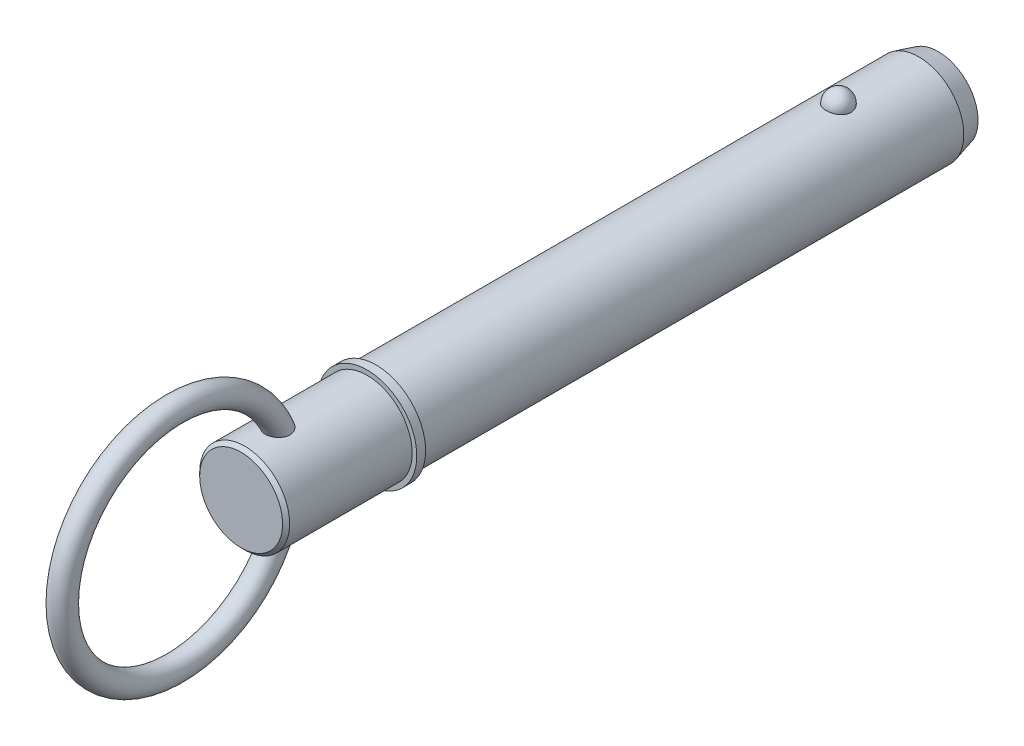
ISO-10303-21;
HEADER;
FILE_DESCRIPTION(('STEP AP214'),'2;1');
FILE_NAME('part.step','',(''),(''),'','','');
FILE_SCHEMA(('AUTOMOTIVE_DESIGN { 1 0 10303 214 1 1 1 1 }'));
ENDSEC;
DATA;
#1=APPLICATION_CONTEXT('core data for automotive mechanical design processes');
#2=APPLICATION_PROTOCOL_DEFINITION('international standard','automotive_design',2000,#1);
#3=PRODUCT_CONTEXT('',#1,'mechanical');
#4=PRODUCT('Part','Part','',(#3));
#5=PRODUCT_RELATED_PRODUCT_CATEGORY('part','',(#4));
#6=PRODUCT_DEFINITION_FORMATION('','',#4);
#7=PRODUCT_DEFINITION_CONTEXT('part definition',#1,'design');
#8=PRODUCT_DEFINITION('design','',#6,#7);
#9=PRODUCT_DEFINITION_SHAPE('','',#8);
#10=(LENGTH_UNIT() NAMED_UNIT(*) SI_UNIT(.MILLI.,.METRE.));
#11=(NAMED_UNIT(*) PLANE_ANGLE_UNIT() SI_UNIT($,.RADIAN.));
#12=(NAMED_UNIT(*) SI_UNIT($,.STERADIAN.) SOLID_ANGLE_UNIT());
#13=UNCERTAINTY_MEASURE_WITH_UNIT(LENGTH_MEASURE(1.E-05),#10,'distance_accuracy_value','');
#14=(GEOMETRIC_REPRESENTATION_CONTEXT(3) GLOBAL_UNCERTAINTY_ASSIGNED_CONTEXT((#13)) GLOBAL_UNIT_ASSIGNED_CONTEXT((#10,
#11,#12)) REPRESENTATION_CONTEXT('',''));
#15=CARTESIAN_POINT('',(0.,0.,0.));
#16=DIRECTION('',(0.,0.,1.));
#17=DIRECTION('',(1.,0.,0.));
#18=AXIS2_PLACEMENT_3D('',#15,#16,#17);
#19=CARTESIAN_POINT('',(0.,0.,127.));
#20=DIRECTION('',(0.,0.,-1.));
#21=DIRECTION('',(-1.,0.,0.));
#22=AXIS2_PLACEMENT_3D('',#19,#20,#21);
#23=CYLINDRICAL_SURFACE('',#22,12.7);
#24=CARTESIAN_POINT('',(3.52486003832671,12.2010393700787,-3.56));
#25=CARTESIAN_POINT('',(3.52485671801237,12.2010422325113,-3.3610062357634));
#26=CARTESIAN_POINT('',(3.50863187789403,12.2057632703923,-3.16197042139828));
#27=CARTESIAN_POINT('',(3.4441205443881,12.2241207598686,-2.76953945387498));
#28=CARTESIAN_POINT('',(3.39582213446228,12.2377605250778,-2.57614642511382));
#29=CARTESIAN_POINT('',(3.26839193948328,12.2724057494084,-2.20059799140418));
#30=CARTESIAN_POINT('',(3.18927369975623,12.2934079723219,-2.01843769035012));
#31=CARTESIAN_POINT('',(3.00217139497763,12.3404306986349,-1.6703228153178));
#32=CARTESIAN_POINT('',(2.89418796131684,12.3664510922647,-1.50436788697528));
#33=CARTESIAN_POINT('',(2.65144862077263,12.4207616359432,-1.19241975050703));
#34=CARTESIAN_POINT('',(2.51656310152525,12.4490623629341,-1.04652919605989));
#35=CARTESIAN_POINT('',(2.22383249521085,12.5046678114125,-0.779711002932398));
#36=CARTESIAN_POINT('',(2.0659873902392,12.5319725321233,-0.658783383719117));
#37=CARTESIAN_POINT('',(1.73204520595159,12.5824645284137,-0.445586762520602));
#38=CARTESIAN_POINT('',(1.55600183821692,12.6056634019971,-0.353236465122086));
#39=CARTESIAN_POINT('',(1.19021695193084,12.6454411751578,-0.199381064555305));
#40=CARTESIAN_POINT('',(1.00047694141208,12.6620208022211,-0.137872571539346));
#41=CARTESIAN_POINT('',(0.616329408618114,12.6864692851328,-0.0483191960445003));
#42=CARTESIAN_POINT('',(0.422067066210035,12.6944893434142,-0.0196927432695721));
#43=CARTESIAN_POINT('',(0.0313259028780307,12.7014637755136,0.00524116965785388));
#44=CARTESIAN_POINT('',(-0.165152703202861,12.7004190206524,0.00155173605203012));
#45=CARTESIAN_POINT('',(-0.551780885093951,12.6894611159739,-0.0377454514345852));
#46=CARTESIAN_POINT('',(-0.74198078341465,12.6796749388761,-0.0728962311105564));
#47=CARTESIAN_POINT('',(-1.11361063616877,12.6524544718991,-0.173489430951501));
#48=CARTESIAN_POINT('',(-1.29504043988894,12.6350200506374,-0.238932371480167));
#49=CARTESIAN_POINT('',(-1.64521311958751,12.5942270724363,-0.398772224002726));
#50=CARTESIAN_POINT('',(-1.81387645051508,12.5708347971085,-0.493334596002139));
#51=CARTESIAN_POINT('',(-2.13292959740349,12.5206522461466,-0.708731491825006));
#52=CARTESIAN_POINT('',(-2.28331755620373,12.4938616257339,-0.829568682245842));
#53=CARTESIAN_POINT('',(-2.56470285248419,12.4391828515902,-1.0968714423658));
#54=CARTESIAN_POINT('',(-2.69527522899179,12.4112835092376,-1.24378221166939));
#55=CARTESIAN_POINT('',(-2.93023079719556,12.3579248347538,-1.55763192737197));
#56=CARTESIAN_POINT('',(-3.03461212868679,12.3324656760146,-1.72457229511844));
#57=CARTESIAN_POINT('',(-3.21564423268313,12.2865167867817,-2.07598316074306));
#58=CARTESIAN_POINT('',(-3.29196222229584,12.2660875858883,-2.26063321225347));
#59=CARTESIAN_POINT('',(-3.41323771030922,12.2328979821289,-2.64061334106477));
#60=CARTESIAN_POINT('',(-3.45819611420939,12.2201373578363,-2.83594310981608));
#61=CARTESIAN_POINT('',(-3.51550038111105,12.2037762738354,-3.2308649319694));
#62=CARTESIAN_POINT('',(-3.5279827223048,12.200137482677,-3.43043558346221));
#63=CARTESIAN_POINT('',(-3.52041430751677,12.2023234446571,-3.8289025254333));
#64=CARTESIAN_POINT('',(-3.50036443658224,12.2081479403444,-4.02779883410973));
#65=CARTESIAN_POINT('',(-3.42842010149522,12.2285446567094,-4.41824213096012));
#66=CARTESIAN_POINT('',(-3.37668525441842,12.243073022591,-4.6098208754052));
#67=CARTESIAN_POINT('',(-3.24279085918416,12.2792134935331,-4.98132360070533));
#68=CARTESIAN_POINT('',(-3.16063009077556,12.300825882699,-5.16124711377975));
#69=CARTESIAN_POINT('',(-2.96738224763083,12.3488691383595,-5.50542856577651));
#70=CARTESIAN_POINT('',(-2.85613997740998,12.3753256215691,-5.66959579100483));
#71=CARTESIAN_POINT('',(-2.60773241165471,12.4300386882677,-5.97665065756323));
#72=CARTESIAN_POINT('',(-2.47056612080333,12.458295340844,-6.11953748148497));
#73=CARTESIAN_POINT('',(-2.17327999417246,12.5135827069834,-6.38059312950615));
#74=CARTESIAN_POINT('',(-2.01307652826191,12.5406084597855,-6.49866785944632));
#75=CARTESIAN_POINT('',(-1.67442544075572,12.5902954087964,-6.70609314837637));
#76=CARTESIAN_POINT('',(-1.49597909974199,12.6129569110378,-6.79544572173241));
#77=CARTESIAN_POINT('',(-1.12819666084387,12.6511224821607,-6.94192787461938));
#78=CARTESIAN_POINT('',(-0.93902400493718,12.666712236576,-6.99944518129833));
#79=CARTESIAN_POINT('',(-0.553267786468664,12.6894125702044,-7.08227444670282));
#80=CARTESIAN_POINT('',(-0.356685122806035,12.6965241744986,-7.10759029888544));
#81=CARTESIAN_POINT('',(0.0343320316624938,12.7014305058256,-7.12510946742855));
#82=CARTESIAN_POINT('',(0.228736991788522,12.6993986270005,-7.11792901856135));
#83=CARTESIAN_POINT('',(0.613493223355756,12.6866339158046,-7.07206766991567));
#84=CARTESIAN_POINT('',(0.803844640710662,12.6759013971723,-7.03338790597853));
#85=CARTESIAN_POINT('',(1.17440741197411,12.6469443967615,-6.925834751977));
#86=CARTESIAN_POINT('',(1.35465462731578,12.6287486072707,-6.85707692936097));
#87=CARTESIAN_POINT('',(1.70092526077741,12.5867908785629,-6.69128257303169));
#88=CARTESIAN_POINT('',(1.86694777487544,12.5630285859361,-6.59424424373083));
#89=CARTESIAN_POINT('',(2.18289085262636,12.5120350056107,-6.3727748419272));
#90=CARTESIAN_POINT('',(2.33252391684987,12.4847559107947,-6.24794475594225));
#91=CARTESIAN_POINT('',(2.60889724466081,12.4299457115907,-5.97511730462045));
#92=CARTESIAN_POINT('',(2.73563353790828,12.4024145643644,-5.82711592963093));
#93=CARTESIAN_POINT('',(2.96505559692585,12.3495984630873,-5.5091226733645));
#94=CARTESIAN_POINT('',(3.06728335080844,12.3243610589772,-5.33879227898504));
#95=CARTESIAN_POINT('',(3.24218794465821,12.2795120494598,-4.98295005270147));
#96=CARTESIAN_POINT('',(3.31487538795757,12.2598984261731,-4.79744369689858));
#97=CARTESIAN_POINT('',(3.42255689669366,12.2302435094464,-4.43775244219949));
#98=CARTESIAN_POINT('',(3.46085292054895,12.2193780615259,-4.264615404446));
#99=CARTESIAN_POINT('',(3.5120056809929,12.2047747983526,-3.9143299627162));
#100=CARTESIAN_POINT('',(3.52486299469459,12.2010368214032,-3.73718164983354));
#101=CARTESIAN_POINT('',(3.52486003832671,12.2010393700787,-3.56));
#102=B_SPLINE_CURVE_WITH_KNOTS('',3,(#24,#25,#26,#27,#28,#29,#30,#31,#32,#33,#34,#35,#36,#37,
#38,#39,#40,#41,#42,#43,#44,#45,#46,#47,#48,#49,#50,#51,#52,#53,#54,#55,#56,#57,#58,#59,#60,#61,
#62,#63,#64,#65,#66,#67,#68,#69,#70,#71,#72,#73,#74,#75,#76,#77,#78,#79,#80,#81,#82,#83,#84,#85,
#86,#87,#88,#89,#90,#91,#92,#93,#94,#95,#96,#97,#98,#99,#100,#101),.UNSPECIFIED.,.T.,.F.,(4,2,2,
2,2,2,2,2,2,2,2,2,2,2,2,2,2,2,2,2,2,2,2,2,2,2,2,2,2,2,2,2,2,2,2,2,2,2,4),(0.,0.596344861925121,
1.19291141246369,1.78921606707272,2.38550767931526,2.98474477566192,3.58398233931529,
4.18149920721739,4.77895038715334,5.36566361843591,5.95232045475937,6.53059198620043,
7.10887345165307,7.6905033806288,8.27219236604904,8.86498552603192,9.45782077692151,
10.0574751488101,10.6571122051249,11.2542252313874,11.8513220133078,12.4454353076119,
13.0395724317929,13.636947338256,14.2343451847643,14.8339691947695,15.4335511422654,
16.0256602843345,16.6176978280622,17.1985559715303,17.7793931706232,18.3580179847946,
18.9366795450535,19.5242567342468,20.1119357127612,20.7098642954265,21.3075780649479,
21.8385683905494,22.3695466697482),.UNSPECIFIED.);
#103=CARTESIAN_POINT('',(3.52486003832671,12.2010393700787,-3.56));
#104=VERTEX_POINT('',#103);
#105=EDGE_CURVE('E101',#104,#104,#102,.T.);
#106=ORIENTED_EDGE('',*,*,#105,.T.);
#107=EDGE_LOOP('',(#106));
#108=FACE_BOUND('',#107,.T.);
#109=CARTESIAN_POINT('',(0.,0.,-26.2499999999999));
#110=DIRECTION('',(0.,0.,-1.));
#111=DIRECTION('',(-1.,0.,0.));
#112=AXIS2_PLACEMENT_3D('',#109,#110,#111);
#113=CIRCLE('',#112,12.7);
#114=CARTESIAN_POINT('',(-12.7,0.,-26.2499999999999));
#115=VERTEX_POINT('',#114);
#116=EDGE_CURVE('E108',#115,#115,#113,.F.);
#117=ORIENTED_EDGE('',*,*,#116,.T.);
#118=EDGE_LOOP('',(#117));
#119=FACE_BOUND('',#118,.T.);
#120=CARTESIAN_POINT('',(0.,0.,127.));
#121=DIRECTION('',(0.,0.,1.));
#122=DIRECTION('',(1.,0.,0.));
#123=AXIS2_PLACEMENT_3D('',#120,#121,#122);
#124=CIRCLE('',#123,12.7);
#125=CARTESIAN_POINT('',(12.7,0.,127.));
#126=VERTEX_POINT('',#125);
#127=EDGE_CURVE('E106',#126,#126,#124,.T.);
#128=ORIENTED_EDGE('',*,*,#127,.F.);
#129=EDGE_LOOP('',(#128));
#130=FACE_BOUND('',#129,.T.);
#131=ADVANCED_FACE('F39',(#108,#119,#130),#23,.T.);
#132=CARTESIAN_POINT('',(0.,0.,-31.75));
#133=DIRECTION('',(0.,0.,-1.));
#134=DIRECTION('',(-1.,0.,0.));
#135=AXIS2_PLACEMENT_3D('',#132,#133,#134);
#136=PLANE('',#135);
#137=CARTESIAN_POINT('',(0.,0.,-31.75));
#138=DIRECTION('',(0.,0.,-1.));
#139=DIRECTION('',(-1.,0.,0.));
#140=AXIS2_PLACEMENT_3D('',#137,#138,#139);
#141=CIRCLE('',#140,11.2262794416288);
#142=CARTESIAN_POINT('',(-11.2262794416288,0.,-31.75));
#143=VERTEX_POINT('',#142);
#144=EDGE_CURVE('E142',#143,#143,#141,.T.);
#145=ORIENTED_EDGE('',*,*,#144,.T.);
#146=EDGE_LOOP('',(#145));
#147=FACE_BOUND('',#146,.T.);
#148=ADVANCED_FACE('F87',(#147),#136,.T.);
#149=CARTESIAN_POINT('',(0.,0.,-31.75));
#150=DIRECTION('',(0.,0.,1.));
#151=DIRECTION('',(1.,0.,0.));
#152=AXIS2_PLACEMENT_3D('',#149,#150,#151);
#153=CONICAL_SURFACE('',#152,11.2262794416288,0.261799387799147);
#154=ORIENTED_EDGE('',*,*,#116,.F.);
#155=EDGE_LOOP('',(#154));
#156=FACE_BOUND('',#155,.T.);
#157=ORIENTED_EDGE('',*,*,#144,.F.);
#158=EDGE_LOOP('',(#157));
#159=FACE_BOUND('',#158,.T.);
#160=ADVANCED_FACE('F93',(#156,#159),#153,.T.);
#161=CARTESIAN_POINT('',(0.,12.7,-3.56));
#162=DIRECTION('',(0.,1.,0.));
#163=DIRECTION('',(0.,0.,-1.));
#164=AXIS2_PLACEMENT_3D('',#161,#162,#163);
#165=SPHERICAL_SURFACE('',#164,3.56);
#166=ORIENTED_EDGE('',*,*,#105,.F.);
#167=EDGE_LOOP('',(#166));
#168=FACE_BOUND('',#167,.T.);
#169=ADVANCED_FACE('F111',(#168),#165,.T.);
#170=CARTESIAN_POINT('',(0.,0.,127.));
#171=DIRECTION('',(0.,0.,-1.));
#172=DIRECTION('',(-1.,0.,0.));
#173=AXIS2_PLACEMENT_3D('',#170,#171,#172);
#174=PLANE('',#173);
#175=ORIENTED_EDGE('',*,*,#127,.T.);
#176=EDGE_LOOP('',(#175));
#177=FACE_BOUND('',#176,.T.);
#178=CARTESIAN_POINT('',(0.,0.,127.));
#179=DIRECTION('',(0.,0.,-1.));
#180=DIRECTION('',(-1.,0.,0.));
#181=AXIS2_PLACEMENT_3D('',#178,#179,#180);
#182=CIRCLE('',#181,14.);
#183=CARTESIAN_POINT('',(-14.,0.,127.));
#184=VERTEX_POINT('',#183);
#185=EDGE_CURVE('E107',#184,#184,#182,.T.);
#186=ORIENTED_EDGE('',*,*,#185,.T.);
#187=EDGE_LOOP('',(#186));
#188=FACE_BOUND('',#187,.T.);
#189=ADVANCED_FACE('F115',(#177,#188),#174,.T.);
#190=CARTESIAN_POINT('',(0.,0.,33.7287874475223));
#191=DIRECTION('',(0.,0.,-1.));
#192=DIRECTION('',(-1.,0.,0.));
#193=AXIS2_PLACEMENT_3D('',#190,#191,#192);
#194=CYLINDRICAL_SURFACE('',#193,14.);
#195=CARTESIAN_POINT('',(0.,0.,129.5));
#196=DIRECTION('',(0.,0.,-1.));
#197=DIRECTION('',(-1.,0.,0.));
#198=AXIS2_PLACEMENT_3D('',#195,#196,#197);
#199=CIRCLE('',#198,14.);
#200=CARTESIAN_POINT('',(-14.,0.,129.5));
#201=VERTEX_POINT('',#200);
#202=EDGE_CURVE('E132',#201,#201,#199,.T.);
#203=ORIENTED_EDGE('',*,*,#202,.T.);
#204=EDGE_LOOP('',(#203));
#205=FACE_BOUND('',#204,.T.);
#206=ORIENTED_EDGE('',*,*,#185,.F.);
#207=EDGE_LOOP('',(#206));
#208=FACE_BOUND('',#207,.T.);
#209=ADVANCED_FACE('F119',(#205,#208),#194,.T.);
#210=CARTESIAN_POINT('',(0.,14.,129.5));
#211=DIRECTION('',(0.,0.,1.));
#212=DIRECTION('',(1.,0.,0.));
#213=AXIS2_PLACEMENT_3D('',#210,#211,#212);
#214=PLANE('',#213);
#215=CARTESIAN_POINT('',(0.,0.,129.5));
#216=DIRECTION('',(0.,0.,1.));
#217=DIRECTION('',(1.,0.,0.));
#218=AXIS2_PLACEMENT_3D('',#215,#216,#217);
#219=CIRCLE('',#218,12.7);
#220=CARTESIAN_POINT('',(12.7,0.,129.5));
#221=VERTEX_POINT('',#220);
#222=EDGE_CURVE('E110',#221,#221,#219,.T.);
#223=ORIENTED_EDGE('',*,*,#222,.F.);
#224=EDGE_LOOP('',(#223));
#225=FACE_BOUND('',#224,.T.);
#226=ORIENTED_EDGE('',*,*,#202,.F.);
#227=EDGE_LOOP('',(#226));
#228=FACE_BOUND('',#227,.T.);
#229=ADVANCED_FACE('F84',(#225,#228),#214,.T.);
#230=CARTESIAN_POINT('',(0.,0.,165.1));
#231=DIRECTION('',(0.,0.,-1.));
#232=DIRECTION('',(-1.,0.,0.));
#233=AXIS2_PLACEMENT_3D('',#230,#231,#232);
#234=CYLINDRICAL_SURFACE('',#233,12.7);
#235=CARTESIAN_POINT('',(-1.22892607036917,-12.6404011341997,151.47119395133));
#236=CARTESIAN_POINT('',(-1.06119922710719,-12.6567092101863,151.404004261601));
#237=CARTESIAN_POINT('',(-0.887663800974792,-12.6701810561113,151.350792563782));
#238=CARTESIAN_POINT('',(-0.533823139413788,-12.6900116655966,151.273419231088));
#239=CARTESIAN_POINT('',(-0.353518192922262,-12.6963707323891,151.2492563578));
#240=CARTESIAN_POINT('',(0.00871153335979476,-12.7012887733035,151.230519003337));
#241=CARTESIAN_POINT('',(0.190636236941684,-12.699848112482,151.235943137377));
#242=CARTESIAN_POINT('',(0.550971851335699,-12.6893231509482,151.276255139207));
#243=CARTESIAN_POINT('',(0.729382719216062,-12.6802387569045,151.31114336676));
#244=CARTESIAN_POINT('',(1.0777168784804,-12.6553960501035,151.409659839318));
#245=CARTESIAN_POINT('',(1.24763507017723,-12.6396337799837,151.473305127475));
#246=CARTESIAN_POINT('',(1.57398922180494,-12.6031560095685,151.627891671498));
#247=CARTESIAN_POINT('',(1.73042571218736,-12.5824407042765,151.718831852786));
#248=CARTESIAN_POINT('',(2.02464767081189,-12.5384554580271,151.925320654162));
#249=CARTESIAN_POINT('',(2.16251370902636,-12.5151974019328,152.04075697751));
#250=CARTESIAN_POINT('',(2.41652917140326,-12.4686447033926,152.293426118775));
#251=CARTESIAN_POINT('',(2.53268123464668,-12.4453500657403,152.430656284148));
#252=CARTESIAN_POINT('',(2.7397169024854,-12.4014166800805,152.72226178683));
#253=CARTESIAN_POINT('',(2.83072997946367,-12.3807646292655,152.876543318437));
#254=CARTESIAN_POINT('',(2.98642630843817,-12.3441356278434,153.198338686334));
#255=CARTESIAN_POINT('',(3.05110876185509,-12.3281588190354,153.365852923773));
#256=CARTESIAN_POINT('',(3.15450336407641,-12.3021148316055,153.712705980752));
#257=CARTESIAN_POINT('',(3.19268116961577,-12.2921697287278,153.892212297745));
#258=CARTESIAN_POINT('',(3.24150148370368,-12.2793848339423,154.255144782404));
#259=CARTESIAN_POINT('',(3.25213515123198,-12.2765473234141,154.438572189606));
#260=CARTESIAN_POINT('',(3.24696781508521,-12.2779158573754,154.818893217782));
#261=CARTESIAN_POINT('',(3.22910261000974,-12.2826719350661,155.015753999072));
#262=CARTESIAN_POINT('',(3.1650495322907,-12.2993299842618,155.40447917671));
#263=CARTESIAN_POINT('',(3.11884966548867,-12.3112349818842,155.596341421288));
#264=CARTESIAN_POINT('',(2.99323123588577,-12.3424162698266,155.992891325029));
#265=CARTESIAN_POINT('',(2.91059577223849,-12.3623844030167,156.196505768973));
#266=CARTESIAN_POINT('',(2.71447440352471,-12.4069229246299,156.588190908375));
#267=CARTESIAN_POINT('',(2.60094970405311,-12.431499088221,156.776241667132));
#268=CARTESIAN_POINT('',(2.40499526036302,-12.4703951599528,157.047470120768));
#269=CARTESIAN_POINT('',(2.33301847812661,-12.4841083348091,157.138407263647));
#270=CARTESIAN_POINT('',(2.18106597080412,-12.5115521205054,157.313320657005));
#271=CARTESIAN_POINT('',(2.10108885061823,-12.5252827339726,157.397295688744));
#272=CARTESIAN_POINT('',(1.84973962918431,-12.5657115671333,157.636779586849));
#273=CARTESIAN_POINT('',(1.6664677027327,-12.5917488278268,157.780526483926));
#274=CARTESIAN_POINT('',(1.33551340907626,-12.6303067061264,157.985856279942));
#275=CARTESIAN_POINT('',(1.19512135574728,-12.6444898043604,158.05902243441));
#276=CARTESIAN_POINT('',(0.903945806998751,-12.6686276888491,158.181586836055));
#277=CARTESIAN_POINT('',(0.753173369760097,-12.6785868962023,158.231009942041));
#278=CARTESIAN_POINT('',(0.444090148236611,-12.6931800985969,158.302942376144));
#279=CARTESIAN_POINT('',(0.285741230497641,-12.6977833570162,158.325296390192));
#280=CARTESIAN_POINT('',(-0.0324491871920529,-12.700953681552,158.340724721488));
#281=CARTESIAN_POINT('',(-0.192290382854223,-12.6995219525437,158.333804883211));
#282=CARTESIAN_POINT('',(-0.493822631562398,-12.6912132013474,158.293209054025));
#283=CARTESIAN_POINT('',(-0.635865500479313,-12.6848307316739,158.261962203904));
#284=CARTESIAN_POINT('',(-0.913041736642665,-12.6678986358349,158.177721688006));
#285=CARTESIAN_POINT('',(-1.04817349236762,-12.6573480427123,158.124722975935));
#286=CARTESIAN_POINT('',(-1.31637898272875,-12.6323524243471,157.996233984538));
#287=CARTESIAN_POINT('',(-1.44890088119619,-12.6177203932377,157.919638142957));
#288=CARTESIAN_POINT('',(-1.70162176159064,-12.5861326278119,157.748743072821));
#289=CARTESIAN_POINT('',(-1.82181486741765,-12.569175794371,157.654435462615));
#290=CARTESIAN_POINT('',(-2.06961284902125,-12.5309682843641,157.432665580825));
#291=CARTESIAN_POINT('',(-2.1945762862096,-12.5094982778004,157.30229330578));
#292=CARTESIAN_POINT('',(-2.4250376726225,-12.4668738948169,157.025308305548));
#293=CARTESIAN_POINT('',(-2.53052086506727,-12.4457197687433,156.878683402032));
#294=CARTESIAN_POINT('',(-2.73961150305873,-12.4015349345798,156.543065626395));
#295=CARTESIAN_POINT('',(-2.83895917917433,-12.3789253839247,156.351346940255));
#296=CARTESIAN_POINT('',(-3.00725804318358,-12.3391195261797,155.954405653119));
#297=CARTESIAN_POINT('',(-3.07618857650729,-12.3219268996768,155.749173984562));
#298=CARTESIAN_POINT('',(-3.18528660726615,-12.2942052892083,155.313754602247));
#299=CARTESIAN_POINT('',(-3.22287145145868,-12.2842816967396,155.082855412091));
#300=CARTESIAN_POINT('',(-3.24821271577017,-12.2775854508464,154.734351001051));
#301=CARTESIAN_POINT('',(-3.25148236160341,-12.276719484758,154.617777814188));
#302=CARTESIAN_POINT('',(-3.24729041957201,-12.2778310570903,154.384859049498));
#303=CARTESIAN_POINT('',(-3.23983534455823,-12.2798068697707,154.268513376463));
#304=CARTESIAN_POINT('',(-3.21488959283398,-12.286359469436,154.04622762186));
#305=CARTESIAN_POINT('',(-3.19823165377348,-12.2907201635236,153.940186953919));
#306=CARTESIAN_POINT('',(-3.15537465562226,-12.3017926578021,153.73022257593));
#307=CARTESIAN_POINT('',(-3.12918076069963,-12.3085031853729,153.626297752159));
#308=CARTESIAN_POINT('',(-3.06721568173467,-12.3240904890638,153.421553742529));
#309=CARTESIAN_POINT('',(-3.03144854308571,-12.3329663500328,153.320733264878));
#310=CARTESIAN_POINT('',(-2.95042598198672,-12.3525998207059,153.123171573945));
#311=CARTESIAN_POINT('',(-2.90517160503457,-12.3633572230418,153.026429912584));
#312=CARTESIAN_POINT('',(-2.81116315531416,-12.3850478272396,152.848857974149));
#313=CARTESIAN_POINT('',(-2.76340897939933,-12.3958187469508,152.767476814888));
#314=CARTESIAN_POINT('',(-2.66091958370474,-12.4182228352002,152.609317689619));
#315=CARTESIAN_POINT('',(-2.60618212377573,-12.4298562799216,152.532541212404));
#316=CARTESIAN_POINT('',(-2.49013138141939,-12.4536239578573,152.384278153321));
#317=CARTESIAN_POINT('',(-2.4288215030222,-12.4657579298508,152.312788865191));
#318=CARTESIAN_POINT('',(-2.30002146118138,-12.4901640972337,152.175587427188));
#319=CARTESIAN_POINT('',(-2.23252894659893,-12.5024363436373,152.109877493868));
#320=CARTESIAN_POINT('',(-2.09370795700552,-12.5264205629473,151.986377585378));
#321=CARTESIAN_POINT('',(-2.02252382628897,-12.5381388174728,151.928426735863));
#322=CARTESIAN_POINT('',(-1.87531735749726,-12.5610012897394,151.81889123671));
#323=CARTESIAN_POINT('',(-1.79929316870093,-12.5721452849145,151.767309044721));
#324=CARTESIAN_POINT('',(-1.5648528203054,-12.6042047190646,151.622706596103));
#325=CARTESIAN_POINT('',(-1.39990754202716,-12.6237766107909,151.539687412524));
#326=CARTESIAN_POINT('',(-1.22892607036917,-12.6404011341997,151.47119395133));
#327=B_SPLINE_CURVE_WITH_KNOTS('',3,(#235,#236,#237,#238,#239,#240,#241,#242,#243,#244,#245,
#246,#247,#248,#249,#250,#251,#252,#253,#254,#255,#256,#257,#258,#259,#260,#261,#262,#263,#264,
#265,#266,#267,#268,#269,#270,#271,#272,#273,#274,#275,#276,#277,#278,#279,#280,#281,#282,#283,
#284,#285,#286,#287,#288,#289,#290,#291,#292,#293,#294,#295,#296,#297,#298,#299,#300,#301,#302,
#303,#304,#305,#306,#307,#308,#309,#310,#311,#312,#313,#314,#315,#316,#317,#318,#319,#320,#321,
#322,#323,#324,#325,#326),.UNSPECIFIED.,.T.,.F.,(4,2,2,2,2,2,2,2,2,2,2,2,2,2,2,2,2,2,2,2,2,2,2,
2,2,2,2,2,2,2,2,2,2,2,2,2,2,2,2,2,2,2,2,2,2,4),(0.,0.543509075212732,1.08699497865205,
1.63045544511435,2.17392254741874,2.71771216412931,3.26148037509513,3.80280767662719,
4.34406914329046,4.88248866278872,5.42092451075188,5.9699227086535,6.51909710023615,
7.10988630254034,7.70092576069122,8.3601374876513,9.02018098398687,9.3700914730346,
9.72006308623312,10.4175255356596,10.8925536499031,11.3670833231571,11.844322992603,
12.3214673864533,12.7562647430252,13.1911630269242,13.6507378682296,14.110530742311,
14.6541210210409,15.1981214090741,15.8467121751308,16.4957426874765,17.1940750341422,
17.5435132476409,17.8927393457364,18.2145822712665,18.536251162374,18.8577843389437,
19.1792821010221,19.463832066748,19.7484735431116,20.0329683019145,20.3175717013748,
20.5948148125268,20.8721645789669,21.4262200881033),.UNSPECIFIED.);
#328=CARTESIAN_POINT('',(-1.22892607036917,-12.6404011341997,151.47119395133));
#329=VERTEX_POINT('',#328);
#330=EDGE_CURVE('E10',#329,#329,#327,.T.);
#331=ORIENTED_EDGE('',*,*,#330,.F.);
#332=EDGE_LOOP('',(#331));
#333=FACE_BOUND('',#332,.T.);
#334=CARTESIAN_POINT('',(-1.22892607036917,12.6404011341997,151.47119395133));
#335=CARTESIAN_POINT('',(-1.39512541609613,12.624240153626,151.53776712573));
#336=CARTESIAN_POINT('',(-1.55582432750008,12.6052778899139,151.618153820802));
#337=CARTESIAN_POINT('',(-1.86136954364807,12.5638060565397,151.804658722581));
#338=CARTESIAN_POINT('',(-2.00617769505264,12.5412882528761,151.910836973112));
#339=CARTESIAN_POINT('',(-2.27547906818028,12.4952333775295,152.146103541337));
#340=CARTESIAN_POINT('',(-2.39998742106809,12.4716970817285,152.275174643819));
#341=CARTESIAN_POINT('',(-2.62534229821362,12.4262157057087,152.552623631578));
#342=CARTESIAN_POINT('',(-2.72620384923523,12.4042696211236,152.700989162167));
#343=CARTESIAN_POINT('',(-2.90197976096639,12.3643304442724,153.0126750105));
#344=CARTESIAN_POINT('',(-2.97691335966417,12.346334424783,153.175984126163));
#345=CARTESIAN_POINT('',(-3.09983588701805,12.3160482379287,153.512927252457));
#346=CARTESIAN_POINT('',(-3.14781852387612,12.3037594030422,153.686563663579));
#347=CARTESIAN_POINT('',(-3.21809353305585,12.2855709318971,154.045523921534));
#348=CARTESIAN_POINT('',(-3.23943500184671,12.2799082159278,154.231044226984));
#349=CARTESIAN_POINT('',(-3.2544382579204,12.2759385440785,154.603232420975));
#350=CARTESIAN_POINT('',(-3.24809142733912,12.2776338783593,154.789900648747));
#351=CARTESIAN_POINT('',(-3.20755159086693,12.288291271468,155.177577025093));
#352=CARTESIAN_POINT('',(-3.17081691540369,12.2979162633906,155.378299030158));
#353=CARTESIAN_POINT('',(-3.06845850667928,12.3238513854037,155.771858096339));
#354=CARTESIAN_POINT('',(-3.00281105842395,12.3401670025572,155.964688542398));
#355=CARTESIAN_POINT('',(-2.83560995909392,12.3797223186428,156.359473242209));
#356=CARTESIAN_POINT('',(-2.73085133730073,12.4035339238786,156.560019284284));
#357=CARTESIAN_POINT('',(-2.48976141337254,12.4541651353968,156.940813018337));
#358=CARTESIAN_POINT('',(-2.35343772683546,12.4809840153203,157.121065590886));
#359=CARTESIAN_POINT('',(-2.0768398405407,12.5296806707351,157.42565995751));
#360=CARTESIAN_POINT('',(-1.94129351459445,12.551613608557,157.554283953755));
#361=CARTESIAN_POINT('',(-1.65081707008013,12.5931023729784,157.787836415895));
#362=CARTESIAN_POINT('',(-1.49591505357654,12.6126615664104,157.892798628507));
#363=CARTESIAN_POINT('',(-1.19690065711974,12.6442092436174,158.057788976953));
#364=CARTESIAN_POINT('',(-1.05541267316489,12.6569190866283,158.122418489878));
#365=CARTESIAN_POINT('',(-0.763415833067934,12.6778764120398,158.227638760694));
#366=CARTESIAN_POINT('',(-0.612913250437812,12.6861269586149,158.268246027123));
#367=CARTESIAN_POINT('',(-0.306168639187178,12.697239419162,158.322715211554));
#368=CARTESIAN_POINT('',(-0.149903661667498,12.7000767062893,158.336454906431));
#369=CARTESIAN_POINT('',(0.16255262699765,12.699920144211,158.33569423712));
#370=CARTESIAN_POINT('',(0.318743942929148,12.6969267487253,158.321196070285));
#371=CARTESIAN_POINT('',(0.614555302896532,12.6859231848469,158.267234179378));
#372=CARTESIAN_POINT('',(0.754548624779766,12.6782987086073,158.229687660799));
#373=CARTESIAN_POINT('',(1.0268504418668,12.6591561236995,158.133711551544));
#374=CARTESIAN_POINT('',(1.15915690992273,12.6476369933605,158.075276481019));
#375=CARTESIAN_POINT('',(1.42405861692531,12.6206654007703,157.934988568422));
#376=CARTESIAN_POINT('',(1.5558287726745,12.604971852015,157.851635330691));
#377=CARTESIAN_POINT('',(1.80621935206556,12.571537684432,157.667498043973));
#378=CARTESIAN_POINT('',(1.92483289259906,12.5537960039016,157.566704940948));
#379=CARTESIAN_POINT('',(2.16936918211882,12.5140714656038,157.330174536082));
#380=CARTESIAN_POINT('',(2.29236422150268,12.4919255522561,157.191439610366));
#381=CARTESIAN_POINT('',(2.5176248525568,12.4484835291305,156.897913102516));
#382=CARTESIAN_POINT('',(2.61987416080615,12.4271880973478,156.743109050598));
#383=CARTESIAN_POINT('',(2.81956306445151,12.3835520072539,156.391316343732));
#384=CARTESIAN_POINT('',(2.91268031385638,12.3617361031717,156.191798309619));
#385=CARTESIAN_POINT('',(3.06675738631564,12.3244204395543,155.779898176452));
#386=CARTESIAN_POINT('',(3.12769905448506,12.3089242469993,155.567508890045));
#387=CARTESIAN_POINT('',(3.19410612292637,12.2917937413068,155.237729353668));
#388=CARTESIAN_POINT('',(3.21217746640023,12.2870696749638,155.122917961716));
#389=CARTESIAN_POINT('',(3.23822570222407,12.2802317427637,154.892095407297));
#390=CARTESIAN_POINT('',(3.24620727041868,12.2781166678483,154.77608482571));
#391=CARTESIAN_POINT('',(3.25166839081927,12.2766712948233,154.54381042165));
#392=CARTESIAN_POINT('',(3.24914931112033,12.2773406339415,154.427546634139));
#393=CARTESIAN_POINT('',(3.23325304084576,12.2815367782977,154.195869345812));
#394=CARTESIAN_POINT('',(3.2198826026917,12.2850618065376,154.08045536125));
#395=CARTESIAN_POINT('',(3.18378347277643,12.2944635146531,153.862188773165));
#396=CARTESIAN_POINT('',(3.16203615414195,12.3000921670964,153.759162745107));
#397=CARTESIAN_POINT('',(3.10931056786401,12.3135262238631,153.555694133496));
#398=CARTESIAN_POINT('',(3.07833729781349,12.3213304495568,153.45525018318));
#399=CARTESIAN_POINT('',(3.00719503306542,12.3388864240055,153.257882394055));
#400=CARTESIAN_POINT('',(2.9670290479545,12.34863753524,153.160957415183));
#401=CARTESIAN_POINT('',(2.87766260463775,12.3697681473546,152.97155308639));
#402=CARTESIAN_POINT('',(2.82846300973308,12.3811474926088,152.879073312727));
#403=CARTESIAN_POINT('',(2.72718770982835,12.4038233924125,152.709278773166));
#404=CARTESIAN_POINT('',(2.67601025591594,12.4149937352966,152.631409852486));
#405=CARTESIAN_POINT('',(2.56702778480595,12.4379850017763,152.480514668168));
#406=CARTESIAN_POINT('',(2.5092205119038,12.4498061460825,152.407490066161));
#407=CARTESIAN_POINT('',(2.38741431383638,12.4737362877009,152.266915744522));
#408=CARTESIAN_POINT('',(2.32341881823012,12.4858451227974,152.199363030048));
#409=CARTESIAN_POINT('',(2.18967865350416,12.5099935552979,152.070183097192));
#410=CARTESIAN_POINT('',(2.11993188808,12.5220331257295,152.008558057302));
#411=CARTESIAN_POINT('',(1.90863625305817,12.5565453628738,151.837971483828));
#412=CARTESIAN_POINT('',(1.75996750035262,12.5784460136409,151.737508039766));
#413=CARTESIAN_POINT('',(1.44761854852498,12.6182083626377,151.562748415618));
#414=CARTESIAN_POINT('',(1.28394037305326,12.6360706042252,151.488448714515));
#415=CARTESIAN_POINT('',(0.945887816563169,12.6658634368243,151.367537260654));
#416=CARTESIAN_POINT('',(0.771499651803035,12.6777861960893,151.320962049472));
#417=CARTESIAN_POINT('',(0.417041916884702,12.694390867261,151.256673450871));
#418=CARTESIAN_POINT('',(0.23696907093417,12.6990685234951,151.238977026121));
#419=CARTESIAN_POINT('',(-0.124879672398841,12.7006841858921,151.232829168));
#420=CARTESIAN_POINT('',(-0.306658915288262,12.6975703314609,151.244573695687));
#421=CARTESIAN_POINT('',(-0.66529779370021,12.6838264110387,151.297473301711));
#422=CARTESIAN_POINT('',(-0.842168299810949,12.6732146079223,151.338556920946));
#423=CARTESIAN_POINT('',(-1.05025519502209,12.6565519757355,151.405394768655));
#424=CARTESIAN_POINT('',(-1.08632235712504,12.6535053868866,151.417681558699));
#425=CARTESIAN_POINT('',(-1.15798463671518,12.6471484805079,151.443501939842));
#426=CARTESIAN_POINT('',(-1.19357974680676,12.643838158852,151.45703555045));
#427=CARTESIAN_POINT('',(-1.22892607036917,12.6404011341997,151.47119395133));
#428=B_SPLINE_CURVE_WITH_KNOTS('',3,(#334,#335,#336,#337,#338,#339,#340,#341,#342,#343,#344,
#345,#346,#347,#348,#349,#350,#351,#352,#353,#354,#355,#356,#357,#358,#359,#360,#361,#362,#363,
#364,#365,#366,#367,#368,#369,#370,#371,#372,#373,#374,#375,#376,#377,#378,#379,#380,#381,#382,
#383,#384,#385,#386,#387,#388,#389,#390,#391,#392,#393,#394,#395,#396,#397,#398,#399,#400,#401,
#402,#403,#404,#405,#406,#407,#408,#409,#410,#411,#412,#413,#414,#415,#416,#417,#418,#419,#420,
#421,#422,#423,#424,#425,#426,#427),.UNSPECIFIED.,.T.,.F.,(4,2,2,2,2,2,2,2,2,2,2,2,2,2,2,2,2,2,
2,2,2,2,2,2,2,2,2,2,2,2,2,2,2,2,2,2,2,2,2,2,2,2,2,2,2,2,4),(0.,0.539146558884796,
1.07956050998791,1.61956978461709,2.15923496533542,2.69849886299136,3.23788860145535,
3.79602631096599,4.3543377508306,4.96471598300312,5.57559579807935,6.25509482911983,
6.93443009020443,7.49671429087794,8.05819140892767,8.52445959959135,8.99040698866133,
9.45846913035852,9.92649485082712,10.3600530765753,10.7937251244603,11.2621204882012,
11.7307597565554,12.2888675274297,12.8474116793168,13.5084064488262,14.1697737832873,
14.5183408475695,14.8667463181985,15.2151063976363,15.5632498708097,15.8791508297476,
16.1948809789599,16.5105079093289,16.826104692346,17.1072964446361,17.3885841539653,
17.669716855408,17.9509524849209,18.490448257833,19.0298713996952,19.5700039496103,
20.1104536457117,20.6545101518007,21.1972460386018,21.3119068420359,21.4265694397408),.UNSPECIFIED.);
#429=CARTESIAN_POINT('',(-1.22892607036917,12.6404011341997,151.47119395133));
#430=VERTEX_POINT('',#429);
#431=EDGE_CURVE('E51',#430,#430,#428,.T.);
#432=ORIENTED_EDGE('',*,*,#431,.F.);
#433=EDGE_LOOP('',(#432));
#434=FACE_BOUND('',#433,.T.);
#435=CARTESIAN_POINT('',(0.,0.,164.1));
#436=DIRECTION('',(0.,0.,-1.));
#437=DIRECTION('',(-1.,0.,0.));
#438=AXIS2_PLACEMENT_3D('',#435,#436,#437);
#439=CIRCLE('',#438,12.7);
#440=CARTESIAN_POINT('',(-12.7,0.,164.1));
#441=VERTEX_POINT('',#440);
#442=EDGE_CURVE('E63',#441,#441,#439,.T.);
#443=ORIENTED_EDGE('',*,*,#442,.T.);
#444=EDGE_LOOP('',(#443));
#445=FACE_BOUND('',#444,.T.);
#446=ORIENTED_EDGE('',*,*,#222,.T.);
#447=EDGE_LOOP('',(#446));
#448=FACE_BOUND('',#447,.T.);
#449=ADVANCED_FACE('F68',(#333,#434,#445,#448),#234,.T.);
#450=CARTESIAN_POINT('',(0.,0.,165.1));
#451=DIRECTION('',(0.,0.,-1.));
#452=DIRECTION('',(-1.,0.,0.));
#453=AXIS2_PLACEMENT_3D('',#450,#451,#452);
#454=PLANE('',#453);
#455=CARTESIAN_POINT('',(0.,0.,165.1));
#456=DIRECTION('',(0.,0.,-1.));
#457=DIRECTION('',(-1.,0.,0.));
#458=AXIS2_PLACEMENT_3D('',#455,#456,#457);
#459=CIRCLE('',#458,11.6999999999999);
#460=CARTESIAN_POINT('',(-11.6999999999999,0.,165.1));
#461=VERTEX_POINT('',#460);
#462=EDGE_CURVE('E57',#461,#461,#459,.F.);
#463=ORIENTED_EDGE('',*,*,#462,.T.);
#464=EDGE_LOOP('',(#463));
#465=FACE_BOUND('',#464,.T.);
#466=ADVANCED_FACE('F75',(#465),#454,.F.);
#467=CARTESIAN_POINT('',(0.,0.,164.1));
#468=DIRECTION('',(0.,0.,-1.));
#469=DIRECTION('',(-1.,0.,0.));
#470=AXIS2_PLACEMENT_3D('',#467,#468,#469);
#471=CONICAL_SURFACE('',#470,12.7,0.785398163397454);
#472=ORIENTED_EDGE('',*,*,#462,.F.);
#473=EDGE_LOOP('',(#472));
#474=FACE_BOUND('',#473,.T.);
#475=ORIENTED_EDGE('',*,*,#442,.F.);
#476=EDGE_LOOP('',(#475));
#477=FACE_BOUND('',#476,.T.);
#478=ADVANCED_FACE('F41',(#474,#477),#471,.T.);
#479=CARTESIAN_POINT('',(0.,0.,183.85));
#480=DIRECTION('',(1.,0.,0.));
#481=DIRECTION('',(0.,0.,-1.));
#482=AXIS2_PLACEMENT_3D('',#479,#480,#481);
#483=TOROIDAL_SURFACE('',#482,31.75,3.25);
#484=ORIENTED_EDGE('',*,*,#330,.T.);
#485=EDGE_LOOP('',(#484));
#486=FACE_BOUND('',#485,.T.);
#487=ORIENTED_EDGE('',*,*,#431,.T.);
#488=EDGE_LOOP('',(#487));
#489=FACE_BOUND('',#488,.T.);
#490=ADVANCED_FACE('F72',(#486,#489),#483,.T.);
#491=CLOSED_SHELL('',(#131,#148,#160,#169,#189,#209,#229,#449,#466,#478,#490));
#492=MANIFOLD_SOLID_BREP('B2',#491);
#493=ADVANCED_BREP_SHAPE_REPRESENTATION('',(#18,#492),#14);
#494=SHAPE_DEFINITION_REPRESENTATION(#9,#493);
ENDSEC;
END-ISO-10303-21;
